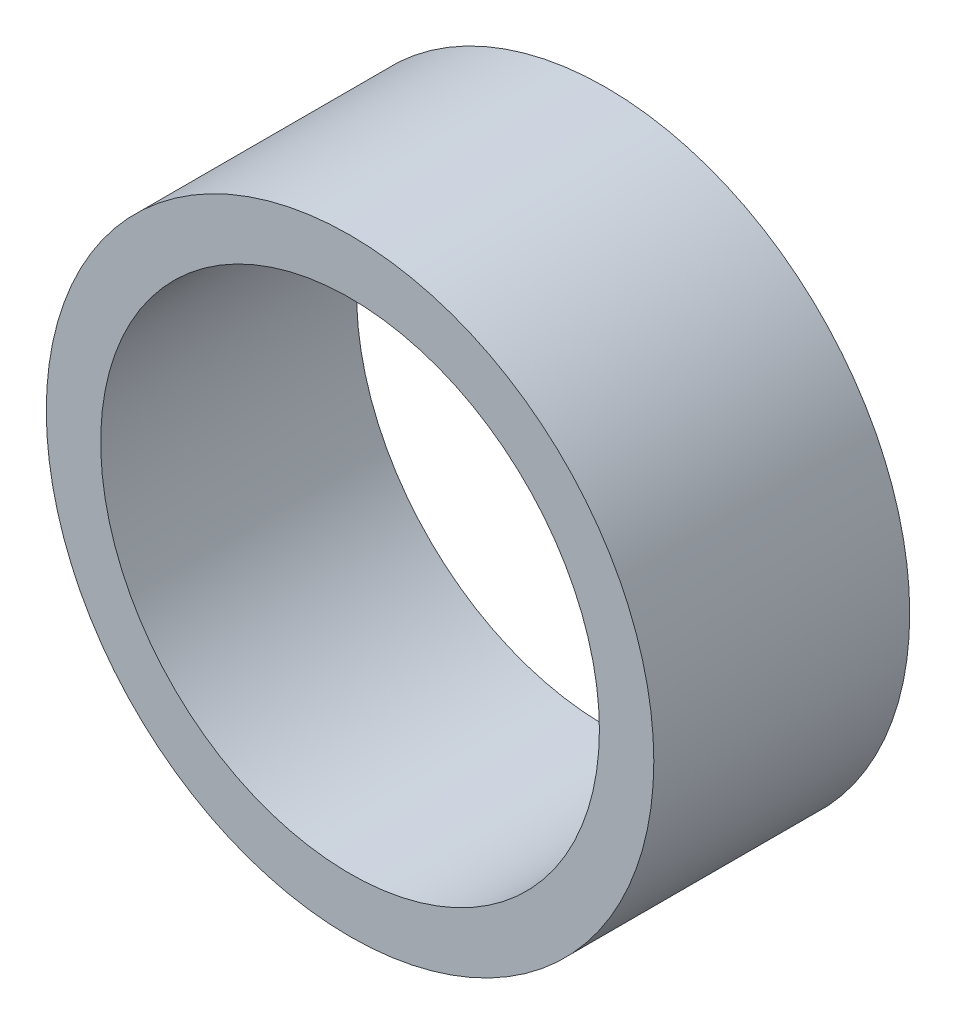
from build123d import *

# Parameters (mm, degrees)
SKETCH1_R         = 30.15
SKETCH1_R_2       = 24.75
BASESECTION_DEPTH = 12.7


with BuildPart() as part:
    # Sketch1 → BaseSection (new, symmetric)
    with BuildSketch(Plane.XY):
        Circle(SKETCH1_R)
        Circle(SKETCH1_R_2, mode=Mode.SUBTRACT)
    extrude(amount=BASESECTION_DEPTH, both=True)


solid = part.part
